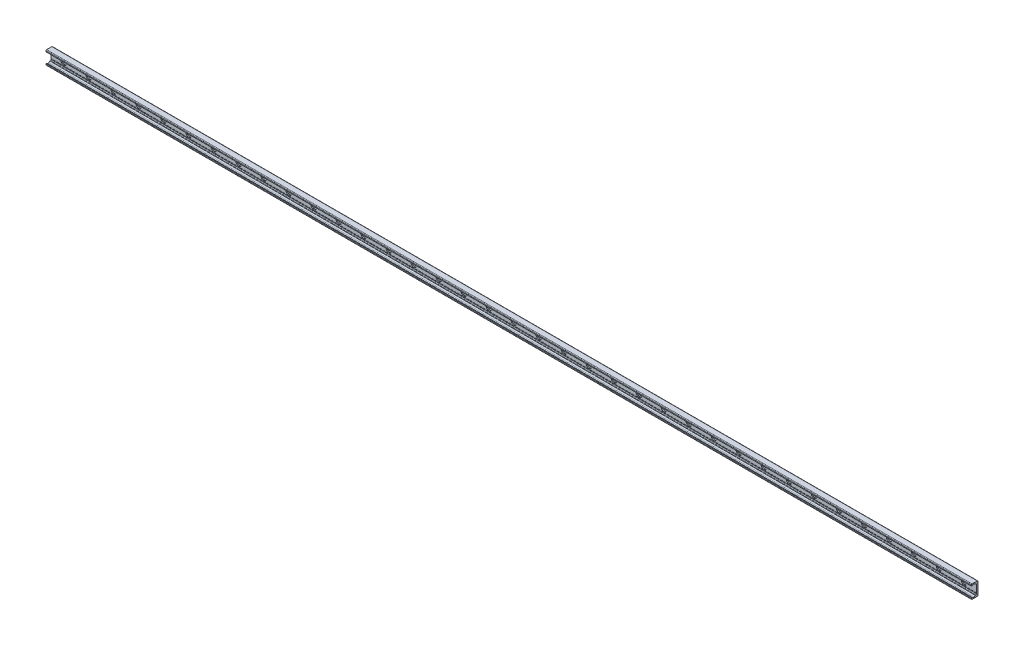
from build123d import *

# Parameters (mm, degrees)
BOSS_EXTRUDE1_DEPTH = 1480
SKETCH2_R           = 9
SKETCH2_R_2         = 4.5
CUT_EXTRUDE1_DEPTH  = 3.1
SKETCH2_2_R         = 4.5
CUT_EXTRUDE2_DEPTH  = 1481.248121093
LPATTERN1_COUNT     = 37
LPATTERN1_PITCH     = 80


with BuildPart() as part:
    # Sketch1 → Boss-Extrude1 (new, symmetric)
    with BuildSketch(Plane(origin=(0, 0, 0), x_dir=(0, 0, -1), z_dir=(1, 0, 0))):
        with BuildLine():
            Line((0, 0), (0, 19))
            ThreePointArc((0, 19), (-0.732233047, 20.767766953), (-2.5, 21.5))
            Line((-2.5, 21.5), (-19, 21.5))
            ThreePointArc((-19, 21.5), (-20.414213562, 20.914213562), (-21, 19.5))
            Line((-21, 19.5), (-21, 16.625057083))
            ThreePointArc((-21, 16.625057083), (-20.553251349, 15.888838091), (-19.693931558, 15.945160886))
            Line((-19.693931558, 15.945160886), (-16.794305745, 17.975500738))
            ThreePointArc((-16.794305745, 17.975500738), (-14.5, 18.69889256), (-12.205694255, 17.975500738))
            Line((-12.205694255, 17.975500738), (-8.829831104, 15.611695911))
            ThreePointArc((-8.829831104, 15.611695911), (-8.28408983, 15.342566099), (-7.682678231, 15.25))
            Line((-7.682678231, 15.25), (-6.5, 15.25))
            ThreePointArc((-6.5, 15.25), (-5.085786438, 14.664213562), (-4.5, 13.25))
            Line((-4.5, 13.25), (-4.5, -10.75))
            ThreePointArc((-4.5, -10.75), (-4.25, -11), (-4.5, -11.25))
            Line((-4.5, -11.25), (-4.5, -12.25))
            ThreePointArc((-4.5, -12.25), (-4.25, -12.5), (-4.5, -12.75))
            Line((-4.5, -12.75), (-4.5, -13.25))
            ThreePointArc((-4.5, -13.25), (-5.085786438, -14.664213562), (-6.5, -15.25))
            Line((-6.5, -15.25), (-7.682678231, -15.25))
            ThreePointArc((-7.682678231, -15.25), (-8.28408983, -15.342566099), (-8.829831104, -15.611695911))
            Line((-8.829831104, -15.611695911), (-12.205694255, -17.975500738))
            ThreePointArc((-12.205694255, -17.975500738), (-14.5, -18.69889256), (-16.794305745, -17.975500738))
            Line((-16.794305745, -17.975500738), (-19.693931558, -15.945160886))
            ThreePointArc((-19.693931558, -15.945160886), (-20.553251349, -15.888838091), (-21, -16.625057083))
            Line((-21, -16.625057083), (-21, -19.5))
            ThreePointArc((-21, -19.5), (-20.414213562, -20.914213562), (-19, -21.5))
            Line((-19, -21.5), (-2.5, -21.5))
            ThreePointArc((-2.5, -21.5), (-0.732233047, -20.767766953), (0, -19))
            Line((0, -19), (0, 0))
        make_face()
    extrude(amount=BOSS_EXTRUDE1_DEPTH, both=True)

    # Sketch2 → Cut-Extrude1 (cut)
    with BuildSketch(Plane.XY.offset(4.5)):
        with Locations((1440, 0)):
            Circle(SKETCH2_R)
        with Locations((1440, 0)):
            Circle(SKETCH2_R_2, mode=Mode.SUBTRACT)
    cut_extrude1 = extrude(amount=-CUT_EXTRUDE1_DEPTH, mode=Mode.SUBTRACT)

    # Sketch2_2 → Cut-Extrude2 (cut, through all)
    with BuildSketch(Plane.XY.offset(4.5)):
        with Locations((1440, 0)):
            Circle(SKETCH2_2_R)
    cut_extrude2 = extrude(amount=-CUT_EXTRUDE2_DEPTH, mode=Mode.SUBTRACT)

    # LPattern1: Cut-Extrude1, Cut-Extrude2 ×37
    with Locations(*[(-i * LPATTERN1_PITCH, 0, 0) for i in range(1, LPATTERN1_COUNT)]):
        add(cut_extrude1, mode=Mode.SUBTRACT)
        add(cut_extrude2, mode=Mode.SUBTRACT)


solid = part.part
